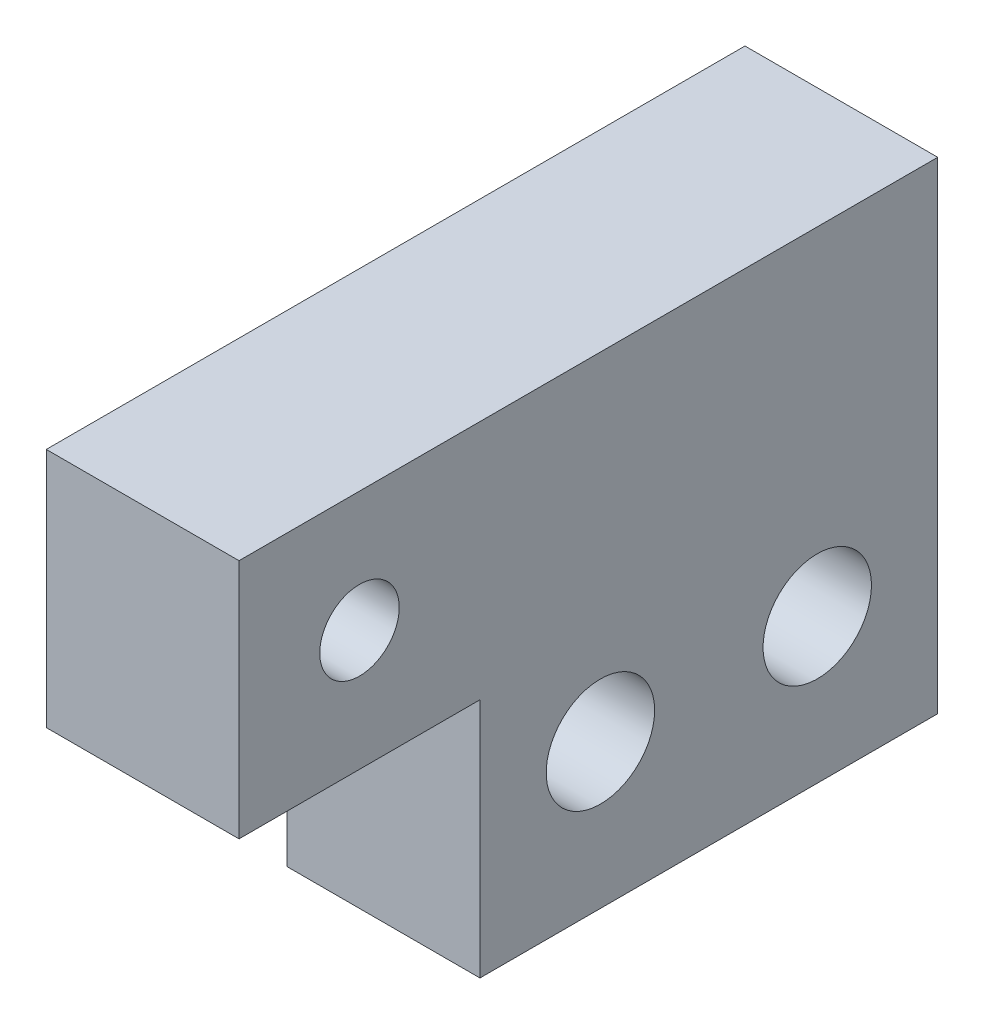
ISO-10303-21;
HEADER;
FILE_DESCRIPTION(('STEP AP214'),'2;1');
FILE_NAME('part.step','',(''),(''),'','','');
FILE_SCHEMA(('AUTOMOTIVE_DESIGN { 1 0 10303 214 1 1 1 1 }'));
ENDSEC;
DATA;
#1=APPLICATION_CONTEXT('core data for automotive mechanical design processes');
#2=APPLICATION_PROTOCOL_DEFINITION('international standard','automotive_design',2000,#1);
#3=PRODUCT_CONTEXT('',#1,'mechanical');
#4=PRODUCT('Part','Part','',(#3));
#5=PRODUCT_RELATED_PRODUCT_CATEGORY('part','',(#4));
#6=PRODUCT_DEFINITION_FORMATION('','',#4);
#7=PRODUCT_DEFINITION_CONTEXT('part definition',#1,'design');
#8=PRODUCT_DEFINITION('design','',#6,#7);
#9=PRODUCT_DEFINITION_SHAPE('','',#8);
#10=(LENGTH_UNIT() NAMED_UNIT(*) SI_UNIT(.MILLI.,.METRE.));
#11=(NAMED_UNIT(*) PLANE_ANGLE_UNIT() SI_UNIT($,.RADIAN.));
#12=(NAMED_UNIT(*) SI_UNIT($,.STERADIAN.) SOLID_ANGLE_UNIT());
#13=UNCERTAINTY_MEASURE_WITH_UNIT(LENGTH_MEASURE(1.E-05),#10,'distance_accuracy_value','');
#14=(GEOMETRIC_REPRESENTATION_CONTEXT(3) GLOBAL_UNCERTAINTY_ASSIGNED_CONTEXT((#13)) GLOBAL_UNIT_ASSIGNED_CONTEXT((#10,
#11,#12)) REPRESENTATION_CONTEXT('',''));
#15=CARTESIAN_POINT('',(0.,0.,0.));
#16=DIRECTION('',(0.,0.,1.));
#17=DIRECTION('',(1.,0.,0.));
#18=AXIS2_PLACEMENT_3D('',#15,#16,#17);
#19=CARTESIAN_POINT('',(-21.,6.,14.));
#20=DIRECTION('',(1.,0.,0.));
#21=DIRECTION('',(0.,0.,-1.));
#22=AXIS2_PLACEMENT_3D('',#19,#20,#21);
#23=CYLINDRICAL_SURFACE('',#22,2.25);
#24=CARTESIAN_POINT('',(8.,6.,14.));
#25=DIRECTION('',(1.,0.,0.));
#26=DIRECTION('',(0.,0.,-1.));
#27=AXIS2_PLACEMENT_3D('',#24,#25,#26);
#28=CIRCLE('',#27,2.25);
#29=CARTESIAN_POINT('',(8.,6.,11.75));
#30=VERTEX_POINT('',#29);
#31=EDGE_CURVE('E105',#30,#30,#28,.T.);
#32=CARTESIAN_POINT('',(4.5,6.,14.));
#33=DIRECTION('',(-1.,0.,0.));
#34=DIRECTION('',(0.,0.,1.));
#35=AXIS2_PLACEMENT_3D('',#32,#33,#34);
#36=CIRCLE('',#35,2.25);
#37=CARTESIAN_POINT('',(4.5,6.,11.75));
#38=VERTEX_POINT('',#37);
#39=EDGE_CURVE('E37',#38,#38,#36,.F.);
#40=CARTESIAN_POINT('',(8.,6.,11.75));
#41=CARTESIAN_POINT('',(7.96354166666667,6.,11.75));
#42=CARTESIAN_POINT('',(7.92708333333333,6.,11.75));
#43=CARTESIAN_POINT('',(7.85416666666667,6.,11.75));
#44=CARTESIAN_POINT('',(7.81770833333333,6.,11.75));
#45=CARTESIAN_POINT('',(7.74479166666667,6.,11.75));
#46=CARTESIAN_POINT('',(7.70833333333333,6.,11.75));
#47=CARTESIAN_POINT('',(7.63541666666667,6.,11.75));
#48=CARTESIAN_POINT('',(7.59895833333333,6.,11.75));
#49=CARTESIAN_POINT('',(7.52604166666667,6.,11.75));
#50=CARTESIAN_POINT('',(7.48958333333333,6.,11.75));
#51=CARTESIAN_POINT('',(7.41666666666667,6.,11.75));
#52=CARTESIAN_POINT('',(7.38020833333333,6.,11.75));
#53=CARTESIAN_POINT('',(7.30729166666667,6.,11.75));
#54=CARTESIAN_POINT('',(7.27083333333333,6.,11.75));
#55=CARTESIAN_POINT('',(7.19791666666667,6.,11.75));
#56=CARTESIAN_POINT('',(7.16145833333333,6.,11.75));
#57=CARTESIAN_POINT('',(7.08854166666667,6.,11.75));
#58=CARTESIAN_POINT('',(7.05208333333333,6.,11.75));
#59=CARTESIAN_POINT('',(6.97916666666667,6.,11.75));
#60=CARTESIAN_POINT('',(6.94270833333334,6.,11.75));
#61=CARTESIAN_POINT('',(6.86979166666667,6.,11.75));
#62=CARTESIAN_POINT('',(6.83333333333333,6.,11.75));
#63=CARTESIAN_POINT('',(6.76041666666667,6.,11.75));
#64=CARTESIAN_POINT('',(6.72395833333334,6.,11.75));
#65=CARTESIAN_POINT('',(6.65104166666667,6.,11.75));
#66=CARTESIAN_POINT('',(6.61458333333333,6.,11.75));
#67=CARTESIAN_POINT('',(6.54166666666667,6.,11.75));
#68=CARTESIAN_POINT('',(6.50520833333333,6.,11.75));
#69=CARTESIAN_POINT('',(6.43229166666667,6.,11.75));
#70=CARTESIAN_POINT('',(6.39583333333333,6.,11.75));
#71=CARTESIAN_POINT('',(6.32291666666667,6.,11.75));
#72=CARTESIAN_POINT('',(6.28645833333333,6.,11.75));
#73=CARTESIAN_POINT('',(6.21354166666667,6.,11.75));
#74=CARTESIAN_POINT('',(6.17708333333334,6.,11.75));
#75=CARTESIAN_POINT('',(6.10416666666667,6.,11.75));
#76=CARTESIAN_POINT('',(6.06770833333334,6.,11.75));
#77=CARTESIAN_POINT('',(5.99479166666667,6.,11.75));
#78=CARTESIAN_POINT('',(5.95833333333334,6.,11.75));
#79=CARTESIAN_POINT('',(5.88541666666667,6.,11.75));
#80=CARTESIAN_POINT('',(5.84895833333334,6.,11.75));
#81=CARTESIAN_POINT('',(5.77604166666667,6.,11.75));
#82=CARTESIAN_POINT('',(5.73958333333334,6.,11.75));
#83=CARTESIAN_POINT('',(5.66666666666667,6.,11.75));
#84=CARTESIAN_POINT('',(5.63020833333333,6.,11.75));
#85=CARTESIAN_POINT('',(5.55729166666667,6.,11.75));
#86=CARTESIAN_POINT('',(5.52083333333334,6.,11.75));
#87=CARTESIAN_POINT('',(5.44791666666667,6.,11.75));
#88=CARTESIAN_POINT('',(5.41145833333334,6.,11.75));
#89=CARTESIAN_POINT('',(5.33854166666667,6.,11.75));
#90=CARTESIAN_POINT('',(5.30208333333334,6.,11.75));
#91=CARTESIAN_POINT('',(5.22916666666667,6.,11.75));
#92=CARTESIAN_POINT('',(5.19270833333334,6.,11.75));
#93=CARTESIAN_POINT('',(5.11979166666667,6.,11.75));
#94=CARTESIAN_POINT('',(5.08333333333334,6.,11.75));
#95=CARTESIAN_POINT('',(5.01041666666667,6.,11.75));
#96=CARTESIAN_POINT('',(4.97395833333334,6.,11.75));
#97=CARTESIAN_POINT('',(4.90104166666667,6.,11.75));
#98=CARTESIAN_POINT('',(4.86458333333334,6.,11.75));
#99=CARTESIAN_POINT('',(4.79166666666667,6.,11.75));
#100=CARTESIAN_POINT('',(4.75520833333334,6.,11.75));
#101=CARTESIAN_POINT('',(4.68229166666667,6.,11.75));
#102=CARTESIAN_POINT('',(4.64583333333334,6.,11.75));
#103=CARTESIAN_POINT('',(4.57291666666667,6.,11.75));
#104=CARTESIAN_POINT('',(4.53645833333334,6.,11.75));
#105=CARTESIAN_POINT('',(4.5,6.,11.75));
#106=B_SPLINE_CURVE_WITH_KNOTS('',3,(#40,#41,#42,#43,#44,#45,#46,#47,#48,#49,#50,#51,#52,#53,
#54,#55,#56,#57,#58,#59,#60,#61,#62,#63,#64,#65,#66,#67,#68,#69,#70,#71,#72,#73,#74,#75,#76,#77,
#78,#79,#80,#81,#82,#83,#84,#85,#86,#87,#88,#89,#90,#91,#92,#93,#94,#95,#96,#97,#98,#99,#100,
#101,#102,#103,#104,#105),.UNSPECIFIED.,.F.,.F.,(4,2,2,2,2,2,2,2,2,2,2,2,2,2,2,2,2,2,2,2,2,2,2,
2,2,2,2,2,2,2,2,2,4),(0.,0.109374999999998,0.21875,0.328124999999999,0.4375,0.546874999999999,
0.656250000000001,0.765624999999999,0.875000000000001,0.984374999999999,1.09375,1.203125,1.3125,
1.421875,1.53125,1.640625,1.75,1.859375,1.96875,2.078125,2.1875,2.296875,2.40625,2.515625,2.625,
2.734375,2.84375,2.953125,3.0625,3.171875,3.28125,3.39062499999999,3.5),.UNSPECIFIED.);
#107=EDGE_CURVE('BSEAM33',#30,#38,#106,.T.);
#108=ORIENTED_EDGE('',*,*,#31,.T.);
#109=ORIENTED_EDGE('',*,*,#39,.F.);
#110=ORIENTED_EDGE('',*,*,#107,.T.);
#111=ORIENTED_EDGE('',*,*,#107,.F.);
#112=EDGE_LOOP('',(#108,#110,#109,#111));
#113=FACE_BOUND('',#112,.T.);
#114=ADVANCED_FACE('F33',(#113),#23,.F.);
#115=CARTESIAN_POINT('',(-21.,6.,5.));
#116=DIRECTION('',(1.,0.,0.));
#117=DIRECTION('',(0.,0.,-1.));
#118=AXIS2_PLACEMENT_3D('',#115,#116,#117);
#119=CYLINDRICAL_SURFACE('',#118,2.25);
#120=CARTESIAN_POINT('',(8.,6.,5.));
#121=DIRECTION('',(1.,0.,0.));
#122=DIRECTION('',(0.,0.,-1.));
#123=AXIS2_PLACEMENT_3D('',#120,#121,#122);
#124=CIRCLE('',#123,2.25);
#125=CARTESIAN_POINT('',(8.,6.,2.75));
#126=VERTEX_POINT('',#125);
#127=EDGE_CURVE('E109',#126,#126,#124,.T.);
#128=CARTESIAN_POINT('',(4.5,6.,5.));
#129=DIRECTION('',(-1.,0.,0.));
#130=DIRECTION('',(0.,0.,1.));
#131=AXIS2_PLACEMENT_3D('',#128,#129,#130);
#132=CIRCLE('',#131,2.25);
#133=CARTESIAN_POINT('',(4.5,6.,2.75));
#134=VERTEX_POINT('',#133);
#135=EDGE_CURVE('E125',#134,#134,#132,.F.);
#136=CARTESIAN_POINT('',(8.,6.,2.75));
#137=CARTESIAN_POINT('',(7.96354166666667,6.,2.75));
#138=CARTESIAN_POINT('',(7.92708333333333,6.,2.75));
#139=CARTESIAN_POINT('',(7.85416666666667,6.,2.75));
#140=CARTESIAN_POINT('',(7.81770833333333,6.,2.75));
#141=CARTESIAN_POINT('',(7.74479166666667,6.,2.75));
#142=CARTESIAN_POINT('',(7.70833333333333,6.,2.75));
#143=CARTESIAN_POINT('',(7.63541666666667,6.,2.75));
#144=CARTESIAN_POINT('',(7.59895833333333,6.,2.75));
#145=CARTESIAN_POINT('',(7.52604166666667,6.,2.75));
#146=CARTESIAN_POINT('',(7.48958333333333,6.,2.75));
#147=CARTESIAN_POINT('',(7.41666666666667,6.,2.75));
#148=CARTESIAN_POINT('',(7.38020833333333,6.,2.75));
#149=CARTESIAN_POINT('',(7.30729166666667,6.,2.75));
#150=CARTESIAN_POINT('',(7.27083333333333,6.,2.75));
#151=CARTESIAN_POINT('',(7.19791666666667,6.,2.75));
#152=CARTESIAN_POINT('',(7.16145833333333,6.,2.75));
#153=CARTESIAN_POINT('',(7.08854166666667,6.,2.75));
#154=CARTESIAN_POINT('',(7.05208333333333,6.,2.75));
#155=CARTESIAN_POINT('',(6.97916666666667,6.,2.75));
#156=CARTESIAN_POINT('',(6.94270833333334,6.,2.75));
#157=CARTESIAN_POINT('',(6.86979166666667,6.,2.75));
#158=CARTESIAN_POINT('',(6.83333333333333,6.,2.75));
#159=CARTESIAN_POINT('',(6.76041666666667,6.,2.75));
#160=CARTESIAN_POINT('',(6.72395833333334,6.,2.75));
#161=CARTESIAN_POINT('',(6.65104166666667,6.,2.75));
#162=CARTESIAN_POINT('',(6.61458333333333,6.,2.75));
#163=CARTESIAN_POINT('',(6.54166666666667,6.,2.75));
#164=CARTESIAN_POINT('',(6.50520833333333,6.,2.75));
#165=CARTESIAN_POINT('',(6.43229166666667,6.,2.75));
#166=CARTESIAN_POINT('',(6.39583333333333,6.,2.75));
#167=CARTESIAN_POINT('',(6.32291666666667,6.,2.75));
#168=CARTESIAN_POINT('',(6.28645833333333,6.,2.75));
#169=CARTESIAN_POINT('',(6.21354166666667,6.,2.75));
#170=CARTESIAN_POINT('',(6.17708333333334,6.,2.75));
#171=CARTESIAN_POINT('',(6.10416666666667,6.,2.75));
#172=CARTESIAN_POINT('',(6.06770833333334,6.,2.75));
#173=CARTESIAN_POINT('',(5.99479166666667,6.,2.75));
#174=CARTESIAN_POINT('',(5.95833333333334,6.,2.75));
#175=CARTESIAN_POINT('',(5.88541666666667,6.,2.75));
#176=CARTESIAN_POINT('',(5.84895833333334,6.,2.75));
#177=CARTESIAN_POINT('',(5.77604166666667,6.,2.75));
#178=CARTESIAN_POINT('',(5.73958333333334,6.,2.75));
#179=CARTESIAN_POINT('',(5.66666666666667,6.,2.75));
#180=CARTESIAN_POINT('',(5.63020833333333,6.,2.75));
#181=CARTESIAN_POINT('',(5.55729166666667,6.,2.75));
#182=CARTESIAN_POINT('',(5.52083333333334,6.,2.75));
#183=CARTESIAN_POINT('',(5.44791666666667,6.,2.75));
#184=CARTESIAN_POINT('',(5.41145833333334,6.,2.75));
#185=CARTESIAN_POINT('',(5.33854166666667,6.,2.75));
#186=CARTESIAN_POINT('',(5.30208333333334,6.,2.75));
#187=CARTESIAN_POINT('',(5.22916666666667,6.,2.75));
#188=CARTESIAN_POINT('',(5.19270833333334,6.,2.75));
#189=CARTESIAN_POINT('',(5.11979166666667,6.,2.75));
#190=CARTESIAN_POINT('',(5.08333333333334,6.,2.75));
#191=CARTESIAN_POINT('',(5.01041666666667,6.,2.75));
#192=CARTESIAN_POINT('',(4.97395833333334,6.,2.75));
#193=CARTESIAN_POINT('',(4.90104166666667,6.,2.75));
#194=CARTESIAN_POINT('',(4.86458333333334,6.,2.75));
#195=CARTESIAN_POINT('',(4.79166666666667,6.,2.75));
#196=CARTESIAN_POINT('',(4.75520833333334,6.,2.75));
#197=CARTESIAN_POINT('',(4.68229166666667,6.,2.75));
#198=CARTESIAN_POINT('',(4.64583333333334,6.,2.75));
#199=CARTESIAN_POINT('',(4.57291666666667,6.,2.75));
#200=CARTESIAN_POINT('',(4.53645833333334,6.,2.75));
#201=CARTESIAN_POINT('',(4.5,6.,2.75));
#202=B_SPLINE_CURVE_WITH_KNOTS('',3,(#136,#137,#138,#139,#140,#141,#142,#143,#144,#145,#146,
#147,#148,#149,#150,#151,#152,#153,#154,#155,#156,#157,#158,#159,#160,#161,#162,#163,#164,#165,
#166,#167,#168,#169,#170,#171,#172,#173,#174,#175,#176,#177,#178,#179,#180,#181,#182,#183,#184,
#185,#186,#187,#188,#189,#190,#191,#192,#193,#194,#195,#196,#197,#198,#199,#200,#201),
.UNSPECIFIED.,.F.,.F.,(4,2,2,2,2,2,2,2,2,2,2,2,2,2,2,2,2,2,2,2,2,2,2,2,2,2,2,2,2,2,2,2,4),(0.,
0.109374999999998,0.21875,0.328124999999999,0.4375,0.546874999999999,0.656250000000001,
0.765624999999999,0.875000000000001,0.984374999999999,1.09375,1.203125,1.3125,1.421875,1.53125,
1.640625,1.75,1.859375,1.96875,2.078125,2.1875,2.296875,2.40625,2.515625,2.625,2.734375,2.84375,
2.953125,3.0625,3.171875,3.28125,3.39062499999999,3.5),.UNSPECIFIED.);
#203=EDGE_CURVE('BSEAM184',#126,#134,#202,.T.);
#204=ORIENTED_EDGE('',*,*,#127,.T.);
#205=ORIENTED_EDGE('',*,*,#135,.F.);
#206=ORIENTED_EDGE('',*,*,#203,.T.);
#207=ORIENTED_EDGE('',*,*,#203,.F.);
#208=EDGE_LOOP('',(#204,#206,#205,#207));
#209=FACE_BOUND('',#208,.T.);
#210=ADVANCED_FACE('F184',(#209),#119,.F.);
#211=CARTESIAN_POINT('',(0.,0.,29.));
#212=DIRECTION('',(0.,1.,0.));
#213=DIRECTION('',(0.,0.,1.));
#214=AXIS2_PLACEMENT_3D('',#211,#212,#213);
#215=PLANE('',#214);
#216=DIRECTION('',(1.,0.,0.));
#217=VECTOR('',#216,1.);
#218=CARTESIAN_POINT('',(-21.,0.,19.));
#219=LINE('',#218,#217);
#220=CARTESIAN_POINT('',(0.,0.,19.));
#221=VERTEX_POINT('',#220);
#222=CARTESIAN_POINT('',(8.,0.,19.));
#223=VERTEX_POINT('',#222);
#224=EDGE_CURVE('E86',#221,#223,#219,.T.);
#225=ORIENTED_EDGE('',*,*,#224,.F.);
#226=DIRECTION('',(0.,0.,-1.));
#227=VECTOR('',#226,1.);
#228=CARTESIAN_POINT('',(0.,0.,29.));
#229=LINE('',#228,#227);
#230=CARTESIAN_POINT('',(0.,0.,0.));
#231=VERTEX_POINT('',#230);
#232=EDGE_CURVE('E79',#221,#231,#229,.T.);
#233=ORIENTED_EDGE('',*,*,#232,.T.);
#234=DIRECTION('',(1.,0.,0.));
#235=VECTOR('',#234,1.);
#236=CARTESIAN_POINT('',(0.,0.,0.));
#237=LINE('',#236,#235);
#238=CARTESIAN_POINT('',(8.,0.,0.));
#239=VERTEX_POINT('',#238);
#240=EDGE_CURVE('E83',#231,#239,#237,.T.);
#241=ORIENTED_EDGE('',*,*,#240,.T.);
#242=DIRECTION('',(0.,0.,-1.));
#243=VECTOR('',#242,1.);
#244=CARTESIAN_POINT('',(8.,0.,29.));
#245=LINE('',#244,#243);
#246=EDGE_CURVE('E119',#223,#239,#245,.T.);
#247=ORIENTED_EDGE('',*,*,#246,.F.);
#248=EDGE_LOOP('',(#225,#233,#241,#247));
#249=FACE_BOUND('',#248,.T.);
#250=ADVANCED_FACE('F35',(#249),#215,.F.);
#251=CARTESIAN_POINT('',(8.,0.,29.));
#252=DIRECTION('',(-1.,0.,0.));
#253=DIRECTION('',(0.,0.,1.));
#254=AXIS2_PLACEMENT_3D('',#251,#252,#253);
#255=PLANE('',#254);
#256=ORIENTED_EDGE('',*,*,#31,.F.);
#257=EDGE_LOOP('',(#256));
#258=FACE_BOUND('',#257,.T.);
#259=ORIENTED_EDGE('',*,*,#127,.F.);
#260=EDGE_LOOP('',(#259));
#261=FACE_BOUND('',#260,.T.);
#262=CARTESIAN_POINT('',(8.,15.,24.));
#263=DIRECTION('',(1.,0.,0.));
#264=DIRECTION('',(0.,0.,-1.));
#265=AXIS2_PLACEMENT_3D('',#262,#263,#264);
#266=CIRCLE('',#265,1.65);
#267=CARTESIAN_POINT('',(8.,15.,22.35));
#268=VERTEX_POINT('',#267);
#269=EDGE_CURVE('E124',#268,#268,#266,.T.);
#270=ORIENTED_EDGE('',*,*,#269,.F.);
#271=EDGE_LOOP('',(#270));
#272=FACE_BOUND('',#271,.T.);
#273=DIRECTION('',(0.,-1.,0.));
#274=VECTOR('',#273,1.);
#275=CARTESIAN_POINT('',(8.,0.,19.));
#276=LINE('',#275,#274);
#277=CARTESIAN_POINT('',(8.,10.,19.));
#278=VERTEX_POINT('',#277);
#279=EDGE_CURVE('E130',#278,#223,#276,.T.);
#280=ORIENTED_EDGE('',*,*,#279,.T.);
#281=ORIENTED_EDGE('',*,*,#246,.T.);
#282=DIRECTION('',(0.,1.,0.));
#283=VECTOR('',#282,1.);
#284=CARTESIAN_POINT('',(8.,0.,0.));
#285=LINE('',#284,#283);
#286=CARTESIAN_POINT('',(8.,20.,0.));
#287=VERTEX_POINT('',#286);
#288=EDGE_CURVE('E104',#239,#287,#285,.T.);
#289=ORIENTED_EDGE('',*,*,#288,.T.);
#290=DIRECTION('',(0.,0.,-1.));
#291=VECTOR('',#290,1.);
#292=CARTESIAN_POINT('',(8.,20.,29.));
#293=LINE('',#292,#291);
#294=CARTESIAN_POINT('',(8.,20.,29.));
#295=VERTEX_POINT('',#294);
#296=EDGE_CURVE('E116',#295,#287,#293,.T.);
#297=ORIENTED_EDGE('',*,*,#296,.F.);
#298=DIRECTION('',(0.,1.,0.));
#299=VECTOR('',#298,1.);
#300=CARTESIAN_POINT('',(8.,0.,29.));
#301=LINE('',#300,#299);
#302=CARTESIAN_POINT('',(8.,10.,29.));
#303=VERTEX_POINT('',#302);
#304=EDGE_CURVE('E99',#303,#295,#301,.T.);
#305=ORIENTED_EDGE('',*,*,#304,.F.);
#306=DIRECTION('',(0.,0.,-1.));
#307=VECTOR('',#306,1.);
#308=CARTESIAN_POINT('',(8.,10.,29.));
#309=LINE('',#308,#307);
#310=EDGE_CURVE('E50',#303,#278,#309,.T.);
#311=ORIENTED_EDGE('',*,*,#310,.T.);
#312=EDGE_LOOP('',(#280,#281,#289,#297,#305,#311));
#313=FACE_BOUND('',#312,.T.);
#314=ADVANCED_FACE('F169',(#258,#261,#272,#313),#255,.F.);
#315=CARTESIAN_POINT('',(0.,0.,29.));
#316=DIRECTION('',(1.,0.,0.));
#317=DIRECTION('',(0.,0.,-1.));
#318=AXIS2_PLACEMENT_3D('',#315,#316,#317);
#319=PLANE('',#318);
#320=CARTESIAN_POINT('',(0.,6.,14.));
#321=DIRECTION('',(-1.,0.,0.));
#322=DIRECTION('',(0.,0.,1.));
#323=AXIS2_PLACEMENT_3D('',#320,#321,#322);
#324=CIRCLE('',#323,4.);
#325=CARTESIAN_POINT('',(0.,6.,18.));
#326=VERTEX_POINT('',#325);
#327=EDGE_CURVE('E140',#326,#326,#324,.T.);
#328=ORIENTED_EDGE('',*,*,#327,.F.);
#329=EDGE_LOOP('',(#328));
#330=FACE_BOUND('',#329,.T.);
#331=CARTESIAN_POINT('',(0.,6.,5.));
#332=DIRECTION('',(-1.,0.,0.));
#333=DIRECTION('',(0.,0.,1.));
#334=AXIS2_PLACEMENT_3D('',#331,#332,#333);
#335=CIRCLE('',#334,4.);
#336=CARTESIAN_POINT('',(0.,6.,9.));
#337=VERTEX_POINT('',#336);
#338=EDGE_CURVE('E133',#337,#337,#335,.T.);
#339=ORIENTED_EDGE('',*,*,#338,.F.);
#340=EDGE_LOOP('',(#339));
#341=FACE_BOUND('',#340,.T.);
#342=CARTESIAN_POINT('',(0.,15.,24.));
#343=DIRECTION('',(1.,0.,0.));
#344=DIRECTION('',(0.,0.,-1.));
#345=AXIS2_PLACEMENT_3D('',#342,#343,#344);
#346=CIRCLE('',#345,1.65);
#347=CARTESIAN_POINT('',(0.,15.,22.35));
#348=VERTEX_POINT('',#347);
#349=EDGE_CURVE('E121',#348,#348,#346,.T.);
#350=ORIENTED_EDGE('',*,*,#349,.T.);
#351=EDGE_LOOP('',(#350));
#352=FACE_BOUND('',#351,.T.);
#353=DIRECTION('',(0.,-1.,0.));
#354=VECTOR('',#353,1.);
#355=CARTESIAN_POINT('',(0.,0.,19.));
#356=LINE('',#355,#354);
#357=CARTESIAN_POINT('',(0.,10.,19.));
#358=VERTEX_POINT('',#357);
#359=EDGE_CURVE('E12',#358,#221,#356,.T.);
#360=ORIENTED_EDGE('',*,*,#359,.F.);
#361=DIRECTION('',(0.,0.,-1.));
#362=VECTOR('',#361,1.);
#363=CARTESIAN_POINT('',(0.,10.,29.));
#364=LINE('',#363,#362);
#365=CARTESIAN_POINT('',(0.,10.,29.));
#366=VERTEX_POINT('',#365);
#367=EDGE_CURVE('E147',#366,#358,#364,.T.);
#368=ORIENTED_EDGE('',*,*,#367,.F.);
#369=DIRECTION('',(0.,-1.,0.));
#370=VECTOR('',#369,1.);
#371=CARTESIAN_POINT('',(0.,0.,29.));
#372=LINE('',#371,#370);
#373=CARTESIAN_POINT('',(0.,20.,29.));
#374=VERTEX_POINT('',#373);
#375=EDGE_CURVE('E90',#374,#366,#372,.T.);
#376=ORIENTED_EDGE('',*,*,#375,.F.);
#377=DIRECTION('',(0.,0.,-1.));
#378=VECTOR('',#377,1.);
#379=CARTESIAN_POINT('',(0.,20.,29.));
#380=LINE('',#379,#378);
#381=CARTESIAN_POINT('',(0.,20.,0.));
#382=VERTEX_POINT('',#381);
#383=EDGE_CURVE('E89',#374,#382,#380,.T.);
#384=ORIENTED_EDGE('',*,*,#383,.T.);
#385=DIRECTION('',(0.,-1.,0.));
#386=VECTOR('',#385,1.);
#387=CARTESIAN_POINT('',(0.,0.,0.));
#388=LINE('',#387,#386);
#389=EDGE_CURVE('E94',#382,#231,#388,.T.);
#390=ORIENTED_EDGE('',*,*,#389,.T.);
#391=ORIENTED_EDGE('',*,*,#232,.F.);
#392=EDGE_LOOP('',(#360,#368,#376,#384,#390,#391));
#393=FACE_BOUND('',#392,.T.);
#394=ADVANCED_FACE('F95',(#330,#341,#352,#393),#319,.F.);
#395=CARTESIAN_POINT('',(8.,0.,29.));
#396=DIRECTION('',(0.,0.,1.));
#397=DIRECTION('',(1.,0.,0.));
#398=AXIS2_PLACEMENT_3D('',#395,#396,#397);
#399=PLANE('',#398);
#400=ORIENTED_EDGE('',*,*,#375,.T.);
#401=DIRECTION('',(1.,0.,0.));
#402=VECTOR('',#401,1.);
#403=CARTESIAN_POINT('',(8.,10.,29.));
#404=LINE('',#403,#402);
#405=EDGE_CURVE('E42',#366,#303,#404,.T.);
#406=ORIENTED_EDGE('',*,*,#405,.T.);
#407=ORIENTED_EDGE('',*,*,#304,.T.);
#408=DIRECTION('',(-1.,0.,0.));
#409=VECTOR('',#408,1.);
#410=CARTESIAN_POINT('',(0.,20.,29.));
#411=LINE('',#410,#409);
#412=EDGE_CURVE('E59',#295,#374,#411,.T.);
#413=ORIENTED_EDGE('',*,*,#412,.T.);
#414=EDGE_LOOP('',(#400,#406,#407,#413));
#415=FACE_BOUND('',#414,.T.);
#416=ADVANCED_FACE('F155',(#415),#399,.T.);
#417=CARTESIAN_POINT('',(0.,20.,29.));
#418=DIRECTION('',(0.,-1.,0.));
#419=DIRECTION('',(0.,0.,-1.));
#420=AXIS2_PLACEMENT_3D('',#417,#418,#419);
#421=PLANE('',#420);
#422=DIRECTION('',(-1.,0.,0.));
#423=VECTOR('',#422,1.);
#424=CARTESIAN_POINT('',(0.,20.,0.));
#425=LINE('',#424,#423);
#426=EDGE_CURVE('E100',#287,#382,#425,.T.);
#427=ORIENTED_EDGE('',*,*,#426,.T.);
#428=ORIENTED_EDGE('',*,*,#383,.F.);
#429=ORIENTED_EDGE('',*,*,#412,.F.);
#430=ORIENTED_EDGE('',*,*,#296,.T.);
#431=EDGE_LOOP('',(#427,#428,#429,#430));
#432=FACE_BOUND('',#431,.T.);
#433=ADVANCED_FACE('F172',(#432),#421,.F.);
#434=CARTESIAN_POINT('',(8.,0.,0.));
#435=DIRECTION('',(0.,0.,1.));
#436=DIRECTION('',(1.,0.,0.));
#437=AXIS2_PLACEMENT_3D('',#434,#435,#436);
#438=PLANE('',#437);
#439=ORIENTED_EDGE('',*,*,#240,.F.);
#440=ORIENTED_EDGE('',*,*,#389,.F.);
#441=ORIENTED_EDGE('',*,*,#426,.F.);
#442=ORIENTED_EDGE('',*,*,#288,.F.);
#443=EDGE_LOOP('',(#439,#440,#441,#442));
#444=FACE_BOUND('',#443,.T.);
#445=ADVANCED_FACE('F103',(#444),#438,.F.);
#446=CARTESIAN_POINT('',(-21.,15.,24.));
#447=DIRECTION('',(1.,0.,0.));
#448=DIRECTION('',(0.,0.,-1.));
#449=AXIS2_PLACEMENT_3D('',#446,#447,#448);
#450=CYLINDRICAL_SURFACE('',#449,1.65);
#451=CARTESIAN_POINT('',(8.,15.,22.35));
#452=CARTESIAN_POINT('',(7.91666666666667,15.,22.35));
#453=CARTESIAN_POINT('',(7.83333333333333,15.,22.35));
#454=CARTESIAN_POINT('',(7.66666666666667,15.,22.35));
#455=CARTESIAN_POINT('',(7.58333333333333,15.,22.35));
#456=CARTESIAN_POINT('',(7.41666666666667,15.,22.35));
#457=CARTESIAN_POINT('',(7.33333333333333,15.,22.35));
#458=CARTESIAN_POINT('',(7.16666666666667,15.,22.35));
#459=CARTESIAN_POINT('',(7.08333333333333,15.,22.35));
#460=CARTESIAN_POINT('',(6.91666666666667,15.,22.35));
#461=CARTESIAN_POINT('',(6.83333333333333,15.,22.35));
#462=CARTESIAN_POINT('',(6.66666666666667,15.,22.35));
#463=CARTESIAN_POINT('',(6.58333333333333,15.,22.35));
#464=CARTESIAN_POINT('',(6.41666666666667,15.,22.35));
#465=CARTESIAN_POINT('',(6.33333333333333,15.,22.35));
#466=CARTESIAN_POINT('',(6.16666666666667,15.,22.35));
#467=CARTESIAN_POINT('',(6.08333333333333,15.,22.35));
#468=CARTESIAN_POINT('',(5.91666666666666,15.,22.35));
#469=CARTESIAN_POINT('',(5.83333333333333,15.,22.35));
#470=CARTESIAN_POINT('',(5.66666666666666,15.,22.35));
#471=CARTESIAN_POINT('',(5.58333333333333,15.,22.35));
#472=CARTESIAN_POINT('',(5.41666666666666,15.,22.35));
#473=CARTESIAN_POINT('',(5.33333333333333,15.,22.35));
#474=CARTESIAN_POINT('',(5.16666666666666,15.,22.35));
#475=CARTESIAN_POINT('',(5.08333333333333,15.,22.35));
#476=CARTESIAN_POINT('',(4.91666666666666,15.,22.35));
#477=CARTESIAN_POINT('',(4.83333333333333,15.,22.35));
#478=CARTESIAN_POINT('',(4.66666666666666,15.,22.35));
#479=CARTESIAN_POINT('',(4.58333333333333,15.,22.35));
#480=CARTESIAN_POINT('',(4.41666666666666,15.,22.35));
#481=CARTESIAN_POINT('',(4.33333333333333,15.,22.35));
#482=CARTESIAN_POINT('',(4.16666666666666,15.,22.35));
#483=CARTESIAN_POINT('',(4.08333333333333,15.,22.35));
#484=CARTESIAN_POINT('',(3.91666666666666,15.,22.35));
#485=CARTESIAN_POINT('',(3.83333333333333,15.,22.35));
#486=CARTESIAN_POINT('',(3.66666666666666,15.,22.35));
#487=CARTESIAN_POINT('',(3.58333333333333,15.,22.35));
#488=CARTESIAN_POINT('',(3.41666666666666,15.,22.35));
#489=CARTESIAN_POINT('',(3.33333333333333,15.,22.35));
#490=CARTESIAN_POINT('',(3.16666666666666,15.,22.35));
#491=CARTESIAN_POINT('',(3.08333333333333,15.,22.35));
#492=CARTESIAN_POINT('',(2.91666666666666,15.,22.35));
#493=CARTESIAN_POINT('',(2.83333333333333,15.,22.35));
#494=CARTESIAN_POINT('',(2.66666666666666,15.,22.35));
#495=CARTESIAN_POINT('',(2.58333333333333,15.,22.35));
#496=CARTESIAN_POINT('',(2.41666666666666,15.,22.35));
#497=CARTESIAN_POINT('',(2.33333333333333,15.,22.35));
#498=CARTESIAN_POINT('',(2.16666666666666,15.,22.35));
#499=CARTESIAN_POINT('',(2.08333333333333,15.,22.35));
#500=CARTESIAN_POINT('',(1.91666666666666,15.,22.35));
#501=CARTESIAN_POINT('',(1.83333333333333,15.,22.35));
#502=CARTESIAN_POINT('',(1.66666666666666,15.,22.35));
#503=CARTESIAN_POINT('',(1.58333333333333,15.,22.35));
#504=CARTESIAN_POINT('',(1.41666666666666,15.,22.35));
#505=CARTESIAN_POINT('',(1.33333333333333,15.,22.35));
#506=CARTESIAN_POINT('',(1.16666666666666,15.,22.35));
#507=CARTESIAN_POINT('',(1.08333333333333,15.,22.35));
#508=CARTESIAN_POINT('',(0.916666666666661,15.,22.35));
#509=CARTESIAN_POINT('',(0.833333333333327,15.,22.35));
#510=CARTESIAN_POINT('',(0.66666666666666,15.,22.35));
#511=CARTESIAN_POINT('',(0.583333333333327,15.,22.35));
#512=CARTESIAN_POINT('',(0.41666666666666,15.,22.35));
#513=CARTESIAN_POINT('',(0.333333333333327,15.,22.35));
#514=CARTESIAN_POINT('',(0.16666666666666,15.,22.35));
#515=CARTESIAN_POINT('',(0.0833333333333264,15.,22.35));
#516=CARTESIAN_POINT('',(0.,15.,22.35));
#517=B_SPLINE_CURVE_WITH_KNOTS('',3,(#451,#452,#453,#454,#455,#456,#457,#458,#459,#460,#461,
#462,#463,#464,#465,#466,#467,#468,#469,#470,#471,#472,#473,#474,#475,#476,#477,#478,#479,#480,
#481,#482,#483,#484,#485,#486,#487,#488,#489,#490,#491,#492,#493,#494,#495,#496,#497,#498,#499,
#500,#501,#502,#503,#504,#505,#506,#507,#508,#509,#510,#511,#512,#513,#514,#515,#516),
.UNSPECIFIED.,.F.,.F.,(4,2,2,2,2,2,2,2,2,2,2,2,2,2,2,2,2,2,2,2,2,2,2,2,2,2,2,2,2,2,2,2,4),(0.,
0.25,0.5,0.750000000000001,1.,1.25,1.5,1.75,2.,2.25,2.5,2.75,3.,3.25,3.5,3.75,4.,4.25,4.5,4.75,
5.,5.25,5.50000000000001,5.75000000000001,6.00000000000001,6.25000000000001,6.50000000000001,
6.75000000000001,7.00000000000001,7.25000000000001,7.50000000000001,7.75000000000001,
8.00000000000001),.UNSPECIFIED.);
#518=EDGE_CURVE('BSEAM179',#268,#348,#517,.T.);
#519=ORIENTED_EDGE('',*,*,#269,.T.);
#520=ORIENTED_EDGE('',*,*,#349,.F.);
#521=ORIENTED_EDGE('',*,*,#518,.T.);
#522=ORIENTED_EDGE('',*,*,#518,.F.);
#523=EDGE_LOOP('',(#519,#521,#520,#522));
#524=FACE_BOUND('',#523,.T.);
#525=ADVANCED_FACE('F179',(#524),#450,.F.);
#526=CARTESIAN_POINT('',(-21.,0.,19.));
#527=DIRECTION('',(0.,0.,1.));
#528=DIRECTION('',(1.,0.,0.));
#529=AXIS2_PLACEMENT_3D('',#526,#527,#528);
#530=PLANE('',#529);
#531=ORIENTED_EDGE('',*,*,#359,.T.);
#532=ORIENTED_EDGE('',*,*,#224,.T.);
#533=ORIENTED_EDGE('',*,*,#279,.F.);
#534=DIRECTION('',(1.,0.,0.));
#535=VECTOR('',#534,1.);
#536=CARTESIAN_POINT('',(-21.,10.,19.));
#537=LINE('',#536,#535);
#538=EDGE_CURVE('E145',#358,#278,#537,.T.);
#539=ORIENTED_EDGE('',*,*,#538,.F.);
#540=EDGE_LOOP('',(#531,#532,#533,#539));
#541=FACE_BOUND('',#540,.T.);
#542=ADVANCED_FACE('F165',(#541),#530,.T.);
#543=CARTESIAN_POINT('',(-21.,10.,29.));
#544=DIRECTION('',(0.,-1.,0.));
#545=DIRECTION('',(0.,0.,-1.));
#546=AXIS2_PLACEMENT_3D('',#543,#544,#545);
#547=PLANE('',#546);
#548=ORIENTED_EDGE('',*,*,#367,.T.);
#549=ORIENTED_EDGE('',*,*,#538,.T.);
#550=ORIENTED_EDGE('',*,*,#310,.F.);
#551=ORIENTED_EDGE('',*,*,#405,.F.);
#552=EDGE_LOOP('',(#548,#549,#550,#551));
#553=FACE_BOUND('',#552,.T.);
#554=ADVANCED_FACE('F160',(#553),#547,.T.);
#555=CARTESIAN_POINT('',(4.5,6.,5.));
#556=DIRECTION('',(-1.,0.,0.));
#557=DIRECTION('',(0.,0.,1.));
#558=AXIS2_PLACEMENT_3D('',#555,#556,#557);
#559=PLANE('',#558);
#560=CARTESIAN_POINT('',(4.5,6.,5.));
#561=DIRECTION('',(-1.,0.,0.));
#562=DIRECTION('',(0.,0.,1.));
#563=AXIS2_PLACEMENT_3D('',#560,#561,#562);
#564=CIRCLE('',#563,4.);
#565=CARTESIAN_POINT('',(4.5,6.,9.));
#566=VERTEX_POINT('',#565);
#567=EDGE_CURVE('E127',#566,#566,#564,.T.);
#568=ORIENTED_EDGE('',*,*,#567,.T.);
#569=EDGE_LOOP('',(#568));
#570=FACE_BOUND('',#569,.T.);
#571=ORIENTED_EDGE('',*,*,#135,.T.);
#572=EDGE_LOOP('',(#571));
#573=FACE_BOUND('',#572,.T.);
#574=ADVANCED_FACE('F215',(#570,#573),#559,.T.);
#575=CARTESIAN_POINT('',(4.5,6.,5.));
#576=DIRECTION('',(-1.,0.,0.));
#577=DIRECTION('',(0.,0.,1.));
#578=AXIS2_PLACEMENT_3D('',#575,#576,#577);
#579=CYLINDRICAL_SURFACE('',#578,4.);
#580=ORIENTED_EDGE('',*,*,#567,.F.);
#581=EDGE_LOOP('',(#580));
#582=FACE_BOUND('',#581,.T.);
#583=ORIENTED_EDGE('',*,*,#338,.T.);
#584=EDGE_LOOP('',(#583));
#585=FACE_BOUND('',#584,.T.);
#586=ADVANCED_FACE('F217',(#582,#585),#579,.F.);
#587=CARTESIAN_POINT('',(4.5,6.,14.));
#588=DIRECTION('',(-1.,0.,0.));
#589=DIRECTION('',(0.,0.,1.));
#590=AXIS2_PLACEMENT_3D('',#587,#588,#589);
#591=PLANE('',#590);
#592=CARTESIAN_POINT('',(4.5,6.,14.));
#593=DIRECTION('',(-1.,0.,0.));
#594=DIRECTION('',(0.,0.,1.));
#595=AXIS2_PLACEMENT_3D('',#592,#593,#594);
#596=CIRCLE('',#595,4.);
#597=CARTESIAN_POINT('',(4.5,6.,18.));
#598=VERTEX_POINT('',#597);
#599=EDGE_CURVE('E235',#598,#598,#596,.T.);
#600=ORIENTED_EDGE('',*,*,#599,.T.);
#601=EDGE_LOOP('',(#600));
#602=FACE_BOUND('',#601,.T.);
#603=ORIENTED_EDGE('',*,*,#39,.T.);
#604=EDGE_LOOP('',(#603));
#605=FACE_BOUND('',#604,.T.);
#606=ADVANCED_FACE('F220',(#602,#605),#591,.T.);
#607=CARTESIAN_POINT('',(4.5,6.,14.));
#608=DIRECTION('',(-1.,0.,0.));
#609=DIRECTION('',(0.,0.,1.));
#610=AXIS2_PLACEMENT_3D('',#607,#608,#609);
#611=CYLINDRICAL_SURFACE('',#610,4.);
#612=ORIENTED_EDGE('',*,*,#599,.F.);
#613=EDGE_LOOP('',(#612));
#614=FACE_BOUND('',#613,.T.);
#615=ORIENTED_EDGE('',*,*,#327,.T.);
#616=EDGE_LOOP('',(#615));
#617=FACE_BOUND('',#616,.T.);
#618=ADVANCED_FACE('F224',(#614,#617),#611,.F.);
#619=CLOSED_SHELL('',(#114,#210,#250,#314,#394,#416,#433,#445,#525,#542,#554,#574,#586,#606,#618));
#620=MANIFOLD_SOLID_BREP('B2',#619);
#621=ADVANCED_BREP_SHAPE_REPRESENTATION('',(#18,#620),#14);
#622=SHAPE_DEFINITION_REPRESENTATION(#9,#621);
ENDSEC;
END-ISO-10303-21;
